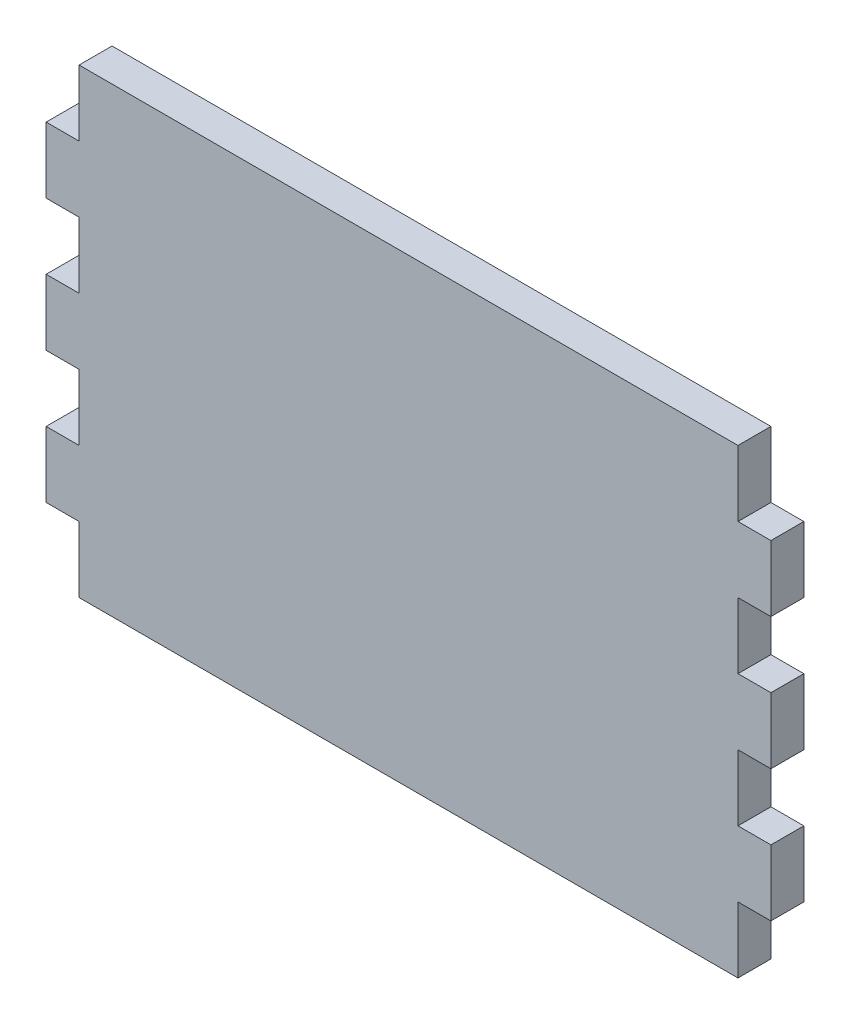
ISO-10303-21;
HEADER;
FILE_DESCRIPTION(('STEP AP214'),'2;1');
FILE_NAME('part.step','',(''),(''),'','','');
FILE_SCHEMA(('AUTOMOTIVE_DESIGN { 1 0 10303 214 1 1 1 1 }'));
ENDSEC;
DATA;
#1=APPLICATION_CONTEXT('core data for automotive mechanical design processes');
#2=APPLICATION_PROTOCOL_DEFINITION('international standard','automotive_design',2000,#1);
#3=PRODUCT_CONTEXT('',#1,'mechanical');
#4=PRODUCT('Part','Part','',(#3));
#5=PRODUCT_RELATED_PRODUCT_CATEGORY('part','',(#4));
#6=PRODUCT_DEFINITION_FORMATION('','',#4);
#7=PRODUCT_DEFINITION_CONTEXT('part definition',#1,'design');
#8=PRODUCT_DEFINITION('design','',#6,#7);
#9=PRODUCT_DEFINITION_SHAPE('','',#8);
#10=(LENGTH_UNIT() NAMED_UNIT(*) SI_UNIT(.MILLI.,.METRE.));
#11=(NAMED_UNIT(*) PLANE_ANGLE_UNIT() SI_UNIT($,.RADIAN.));
#12=(NAMED_UNIT(*) SI_UNIT($,.STERADIAN.) SOLID_ANGLE_UNIT());
#13=UNCERTAINTY_MEASURE_WITH_UNIT(LENGTH_MEASURE(1.E-05),#10,'distance_accuracy_value','');
#14=(GEOMETRIC_REPRESENTATION_CONTEXT(3) GLOBAL_UNCERTAINTY_ASSIGNED_CONTEXT((#13)) GLOBAL_UNIT_ASSIGNED_CONTEXT((#10,
#11,#12)) REPRESENTATION_CONTEXT('',''));
#15=CARTESIAN_POINT('',(0.,0.,0.));
#16=DIRECTION('',(0.,0.,1.));
#17=DIRECTION('',(1.,0.,0.));
#18=AXIS2_PLACEMENT_3D('',#15,#16,#17);
#19=CARTESIAN_POINT('',(50.,-35.,5.));
#20=DIRECTION('',(-1.,0.,0.));
#21=DIRECTION('',(0.,0.,1.));
#22=AXIS2_PLACEMENT_3D('',#19,#20,#21);
#23=PLANE('',#22);
#24=DIRECTION('',(0.,1.,0.));
#25=VECTOR('',#24,1.);
#26=CARTESIAN_POINT('',(50.,-35.,5.));
#27=LINE('',#26,#25);
#28=CARTESIAN_POINT('',(50.,25.,5.));
#29=VERTEX_POINT('',#28);
#30=CARTESIAN_POINT('',(50.,35.,5.));
#31=VERTEX_POINT('',#30);
#32=EDGE_CURVE('E389',#29,#31,#27,.T.);
#33=ORIENTED_EDGE('',*,*,#32,.F.);
#34=DIRECTION('',(0.,0.,-1.));
#35=VECTOR('',#34,1.);
#36=CARTESIAN_POINT('',(50.,25.,5.));
#37=LINE('',#36,#35);
#38=CARTESIAN_POINT('',(50.,25.,0.));
#39=VERTEX_POINT('',#38);
#40=EDGE_CURVE('E278',#29,#39,#37,.T.);
#41=ORIENTED_EDGE('',*,*,#40,.T.);
#42=DIRECTION('',(0.,1.,0.));
#43=VECTOR('',#42,1.);
#44=CARTESIAN_POINT('',(50.,-35.,0.));
#45=LINE('',#44,#43);
#46=CARTESIAN_POINT('',(50.,35.,0.));
#47=VERTEX_POINT('',#46);
#48=EDGE_CURVE('E383',#39,#47,#45,.T.);
#49=ORIENTED_EDGE('',*,*,#48,.T.);
#50=DIRECTION('',(0.,0.,-1.));
#51=VECTOR('',#50,1.);
#52=CARTESIAN_POINT('',(50.,35.,5.));
#53=LINE('',#52,#51);
#54=EDGE_CURVE('E11',#31,#47,#53,.T.);
#55=ORIENTED_EDGE('',*,*,#54,.F.);
#56=EDGE_LOOP('',(#33,#41,#49,#55));
#57=FACE_BOUND('',#56,.T.);
#58=ADVANCED_FACE('F39',(#57),#23,.F.);
#59=CARTESIAN_POINT('',(-50.,-35.,5.));
#60=DIRECTION('',(1.,0.,0.));
#61=DIRECTION('',(0.,0.,-1.));
#62=AXIS2_PLACEMENT_3D('',#59,#60,#61);
#63=PLANE('',#62);
#64=DIRECTION('',(0.,-1.,0.));
#65=VECTOR('',#64,1.);
#66=CARTESIAN_POINT('',(-50.,-35.,0.));
#67=LINE('',#66,#65);
#68=CARTESIAN_POINT('',(-50.,35.,0.));
#69=VERTEX_POINT('',#68);
#70=CARTESIAN_POINT('',(-50.,25.,0.));
#71=VERTEX_POINT('',#70);
#72=EDGE_CURVE('E406',#69,#71,#67,.T.);
#73=ORIENTED_EDGE('',*,*,#72,.T.);
#74=DIRECTION('',(0.,0.,1.));
#75=VECTOR('',#74,1.);
#76=CARTESIAN_POINT('',(-50.,25.,5.));
#77=LINE('',#76,#75);
#78=CARTESIAN_POINT('',(-50.,25.,5.));
#79=VERTEX_POINT('',#78);
#80=EDGE_CURVE('E275',#71,#79,#77,.T.);
#81=ORIENTED_EDGE('',*,*,#80,.T.);
#82=DIRECTION('',(0.,-1.,0.));
#83=VECTOR('',#82,1.);
#84=CARTESIAN_POINT('',(-50.,-35.,5.));
#85=LINE('',#84,#83);
#86=CARTESIAN_POINT('',(-50.,35.,5.));
#87=VERTEX_POINT('',#86);
#88=EDGE_CURVE('E392',#87,#79,#85,.T.);
#89=ORIENTED_EDGE('',*,*,#88,.F.);
#90=DIRECTION('',(0.,0.,-1.));
#91=VECTOR('',#90,1.);
#92=CARTESIAN_POINT('',(-50.,35.,5.));
#93=LINE('',#92,#91);
#94=EDGE_CURVE('E47',#87,#69,#93,.T.);
#95=ORIENTED_EDGE('',*,*,#94,.T.);
#96=EDGE_LOOP('',(#73,#81,#89,#95));
#97=FACE_BOUND('',#96,.T.);
#98=ADVANCED_FACE('F421',(#97),#63,.F.);
#99=CARTESIAN_POINT('',(50.,5.,0.));
#100=VERTEX_POINT('',#99);
#101=CARTESIAN_POINT('',(50.,15.,0.));
#102=VERTEX_POINT('',#101);
#103=EDGE_CURVE('E438',#100,#102,#45,.T.);
#104=ORIENTED_EDGE('',*,*,#103,.T.);
#105=DIRECTION('',(0.,0.,1.));
#106=VECTOR('',#105,1.);
#107=CARTESIAN_POINT('',(50.,15.,5.));
#108=LINE('',#107,#106);
#109=CARTESIAN_POINT('',(50.,15.,5.));
#110=VERTEX_POINT('',#109);
#111=EDGE_CURVE('E273',#102,#110,#108,.T.);
#112=ORIENTED_EDGE('',*,*,#111,.T.);
#113=CARTESIAN_POINT('',(50.,5.,5.));
#114=VERTEX_POINT('',#113);
#115=EDGE_CURVE('E230',#114,#110,#27,.T.);
#116=ORIENTED_EDGE('',*,*,#115,.F.);
#117=DIRECTION('',(0.,0.,-1.));
#118=VECTOR('',#117,1.);
#119=CARTESIAN_POINT('',(50.,5.,5.00000000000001));
#120=LINE('',#119,#118);
#121=EDGE_CURVE('E329',#114,#100,#120,.T.);
#122=ORIENTED_EDGE('',*,*,#121,.T.);
#123=EDGE_LOOP('',(#104,#112,#116,#122));
#124=FACE_BOUND('',#123,.T.);
#125=ADVANCED_FACE('F509',(#124),#23,.F.);
#126=CARTESIAN_POINT('',(-50.,15.,5.));
#127=VERTEX_POINT('',#126);
#128=CARTESIAN_POINT('',(-50.,5.,5.));
#129=VERTEX_POINT('',#128);
#130=EDGE_CURVE('E396',#127,#129,#85,.T.);
#131=ORIENTED_EDGE('',*,*,#130,.F.);
#132=DIRECTION('',(0.,0.,-1.));
#133=VECTOR('',#132,1.);
#134=CARTESIAN_POINT('',(-50.,15.,5.));
#135=LINE('',#134,#133);
#136=CARTESIAN_POINT('',(-50.,15.,0.));
#137=VERTEX_POINT('',#136);
#138=EDGE_CURVE('E264',#127,#137,#135,.T.);
#139=ORIENTED_EDGE('',*,*,#138,.T.);
#140=CARTESIAN_POINT('',(-50.,5.,0.));
#141=VERTEX_POINT('',#140);
#142=EDGE_CURVE('E410',#137,#141,#67,.T.);
#143=ORIENTED_EDGE('',*,*,#142,.T.);
#144=DIRECTION('',(0.,0.,1.));
#145=VECTOR('',#144,1.);
#146=CARTESIAN_POINT('',(-50.,5.,5.00000000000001));
#147=LINE('',#146,#145);
#148=EDGE_CURVE('E326',#141,#129,#147,.T.);
#149=ORIENTED_EDGE('',*,*,#148,.T.);
#150=EDGE_LOOP('',(#131,#139,#143,#149));
#151=FACE_BOUND('',#150,.T.);
#152=ADVANCED_FACE('F487',(#151),#63,.F.);
#153=CARTESIAN_POINT('',(50.,-15.,0.));
#154=VERTEX_POINT('',#153);
#155=CARTESIAN_POINT('',(50.,-5.,0.));
#156=VERTEX_POINT('',#155);
#157=EDGE_CURVE('E403',#154,#156,#45,.T.);
#158=ORIENTED_EDGE('',*,*,#157,.T.);
#159=DIRECTION('',(0.,0.,1.));
#160=VECTOR('',#159,1.);
#161=CARTESIAN_POINT('',(50.,-5.,5.));
#162=LINE('',#161,#160);
#163=CARTESIAN_POINT('',(50.,-5.,5.));
#164=VERTEX_POINT('',#163);
#165=EDGE_CURVE('E323',#156,#164,#162,.T.);
#166=ORIENTED_EDGE('',*,*,#165,.T.);
#167=CARTESIAN_POINT('',(50.,-15.,5.));
#168=VERTEX_POINT('',#167);
#169=EDGE_CURVE('E388',#168,#164,#27,.T.);
#170=ORIENTED_EDGE('',*,*,#169,.F.);
#171=DIRECTION('',(0.,0.,-1.));
#172=VECTOR('',#171,1.);
#173=CARTESIAN_POINT('',(50.,-15.,5.00000000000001));
#174=LINE('',#173,#172);
#175=EDGE_CURVE('E380',#168,#154,#174,.T.);
#176=ORIENTED_EDGE('',*,*,#175,.T.);
#177=EDGE_LOOP('',(#158,#166,#170,#176));
#178=FACE_BOUND('',#177,.T.);
#179=ADVANCED_FACE('F445',(#178),#23,.F.);
#180=CARTESIAN_POINT('',(-50.,-5.,5.));
#181=VERTEX_POINT('',#180);
#182=CARTESIAN_POINT('',(-50.,-15.,5.));
#183=VERTEX_POINT('',#182);
#184=EDGE_CURVE('E497',#181,#183,#85,.T.);
#185=ORIENTED_EDGE('',*,*,#184,.F.);
#186=DIRECTION('',(0.,0.,-1.));
#187=VECTOR('',#186,1.);
#188=CARTESIAN_POINT('',(-50.,-5.,5.));
#189=LINE('',#188,#187);
#190=CARTESIAN_POINT('',(-50.,-5.,0.));
#191=VERTEX_POINT('',#190);
#192=EDGE_CURVE('E309',#181,#191,#189,.T.);
#193=ORIENTED_EDGE('',*,*,#192,.T.);
#194=CARTESIAN_POINT('',(-50.,-15.,0.));
#195=VERTEX_POINT('',#194);
#196=EDGE_CURVE('E480',#191,#195,#67,.T.);
#197=ORIENTED_EDGE('',*,*,#196,.T.);
#198=DIRECTION('',(0.,0.,1.));
#199=VECTOR('',#198,1.);
#200=CARTESIAN_POINT('',(-50.,-15.,5.00000000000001));
#201=LINE('',#200,#199);
#202=EDGE_CURVE('E377',#195,#183,#201,.T.);
#203=ORIENTED_EDGE('',*,*,#202,.T.);
#204=EDGE_LOOP('',(#185,#193,#197,#203));
#205=FACE_BOUND('',#204,.T.);
#206=ADVANCED_FACE('F502',(#205),#63,.F.);
#207=CARTESIAN_POINT('',(50.,-35.,0.));
#208=VERTEX_POINT('',#207);
#209=CARTESIAN_POINT('',(50.,-25.,0.));
#210=VERTEX_POINT('',#209);
#211=EDGE_CURVE('E399',#208,#210,#45,.T.);
#212=ORIENTED_EDGE('',*,*,#211,.T.);
#213=DIRECTION('',(0.,0.,1.));
#214=VECTOR('',#213,1.);
#215=CARTESIAN_POINT('',(50.,-25.,5.));
#216=LINE('',#215,#214);
#217=CARTESIAN_POINT('',(50.,-25.,5.));
#218=VERTEX_POINT('',#217);
#219=EDGE_CURVE('E374',#210,#218,#216,.T.);
#220=ORIENTED_EDGE('',*,*,#219,.T.);
#221=CARTESIAN_POINT('',(50.,-35.,5.));
#222=VERTEX_POINT('',#221);
#223=EDGE_CURVE('E384',#222,#218,#27,.T.);
#224=ORIENTED_EDGE('',*,*,#223,.F.);
#225=DIRECTION('',(0.,0.,-1.));
#226=VECTOR('',#225,1.);
#227=CARTESIAN_POINT('',(50.,-35.,5.));
#228=LINE('',#227,#226);
#229=EDGE_CURVE('E398',#222,#208,#228,.T.);
#230=ORIENTED_EDGE('',*,*,#229,.T.);
#231=EDGE_LOOP('',(#212,#220,#224,#230));
#232=FACE_BOUND('',#231,.T.);
#233=ADVANCED_FACE('F41',(#232),#23,.F.);
#234=CARTESIAN_POINT('',(-50.,35.,5.));
#235=DIRECTION('',(0.,-1.,0.));
#236=DIRECTION('',(0.,0.,-1.));
#237=AXIS2_PLACEMENT_3D('',#234,#235,#236);
#238=PLANE('',#237);
#239=DIRECTION('',(-1.,0.,0.));
#240=VECTOR('',#239,1.);
#241=CARTESIAN_POINT('',(-50.,35.,0.));
#242=LINE('',#241,#240);
#243=EDGE_CURVE('E402',#47,#69,#242,.T.);
#244=ORIENTED_EDGE('',*,*,#243,.T.);
#245=ORIENTED_EDGE('',*,*,#94,.F.);
#246=DIRECTION('',(-1.,0.,0.));
#247=VECTOR('',#246,1.);
#248=CARTESIAN_POINT('',(-50.,35.,5.));
#249=LINE('',#248,#247);
#250=EDGE_CURVE('E387',#31,#87,#249,.T.);
#251=ORIENTED_EDGE('',*,*,#250,.F.);
#252=ORIENTED_EDGE('',*,*,#54,.T.);
#253=EDGE_LOOP('',(#244,#245,#251,#252));
#254=FACE_BOUND('',#253,.T.);
#255=ADVANCED_FACE('F436',(#254),#238,.F.);
#256=CARTESIAN_POINT('',(-50.,-25.,5.));
#257=VERTEX_POINT('',#256);
#258=CARTESIAN_POINT('',(-50.,-35.,5.));
#259=VERTEX_POINT('',#258);
#260=EDGE_CURVE('E391',#257,#259,#85,.T.);
#261=ORIENTED_EDGE('',*,*,#260,.F.);
#262=DIRECTION('',(0.,0.,-1.));
#263=VECTOR('',#262,1.);
#264=CARTESIAN_POINT('',(-50.,-25.,5.));
#265=LINE('',#264,#263);
#266=CARTESIAN_POINT('',(-50.,-25.,0.));
#267=VERTEX_POINT('',#266);
#268=EDGE_CURVE('E360',#257,#267,#265,.T.);
#269=ORIENTED_EDGE('',*,*,#268,.T.);
#270=CARTESIAN_POINT('',(-50.,-35.,0.));
#271=VERTEX_POINT('',#270);
#272=EDGE_CURVE('E405',#267,#271,#67,.T.);
#273=ORIENTED_EDGE('',*,*,#272,.T.);
#274=DIRECTION('',(0.,0.,-1.));
#275=VECTOR('',#274,1.);
#276=CARTESIAN_POINT('',(-50.,-35.,5.));
#277=LINE('',#276,#275);
#278=EDGE_CURVE('E414',#259,#271,#277,.T.);
#279=ORIENTED_EDGE('',*,*,#278,.F.);
#280=EDGE_LOOP('',(#261,#269,#273,#279));
#281=FACE_BOUND('',#280,.T.);
#282=ADVANCED_FACE('F499',(#281),#63,.F.);
#283=CARTESIAN_POINT('',(-50.,-35.,5.));
#284=DIRECTION('',(0.,1.,0.));
#285=DIRECTION('',(0.,0.,1.));
#286=AXIS2_PLACEMENT_3D('',#283,#284,#285);
#287=PLANE('',#286);
#288=DIRECTION('',(1.,0.,0.));
#289=VECTOR('',#288,1.);
#290=CARTESIAN_POINT('',(-50.,-35.,0.));
#291=LINE('',#290,#289);
#292=EDGE_CURVE('E409',#271,#208,#291,.T.);
#293=ORIENTED_EDGE('',*,*,#292,.T.);
#294=ORIENTED_EDGE('',*,*,#229,.F.);
#295=DIRECTION('',(1.,0.,0.));
#296=VECTOR('',#295,1.);
#297=CARTESIAN_POINT('',(-50.,-35.,5.));
#298=LINE('',#297,#296);
#299=EDGE_CURVE('E395',#259,#222,#298,.T.);
#300=ORIENTED_EDGE('',*,*,#299,.F.);
#301=ORIENTED_EDGE('',*,*,#278,.T.);
#302=EDGE_LOOP('',(#293,#294,#300,#301));
#303=FACE_BOUND('',#302,.T.);
#304=ADVANCED_FACE('F475',(#303),#287,.F.);
#305=CARTESIAN_POINT('',(0.,0.,5.));
#306=DIRECTION('',(0.,0.,-1.));
#307=DIRECTION('',(-1.,0.,0.));
#308=AXIS2_PLACEMENT_3D('',#305,#306,#307);
#309=PLANE('',#308);
#310=ORIENTED_EDGE('',*,*,#115,.T.);
#311=DIRECTION('',(1.,0.,0.));
#312=VECTOR('',#311,1.);
#313=CARTESIAN_POINT('',(-55.,15.,5.));
#314=LINE('',#313,#312);
#315=CARTESIAN_POINT('',(55.,15.,5.));
#316=VERTEX_POINT('',#315);
#317=EDGE_CURVE('E54',#110,#316,#314,.T.);
#318=ORIENTED_EDGE('',*,*,#317,.T.);
#319=DIRECTION('',(0.,-1.,0.));
#320=VECTOR('',#319,1.);
#321=CARTESIAN_POINT('',(55.,15.,5.));
#322=LINE('',#321,#320);
#323=CARTESIAN_POINT('',(55.,25.,5.));
#324=VERTEX_POINT('',#323);
#325=EDGE_CURVE('E227',#324,#316,#322,.T.);
#326=ORIENTED_EDGE('',*,*,#325,.F.);
#327=DIRECTION('',(1.,0.,0.));
#328=VECTOR('',#327,1.);
#329=CARTESIAN_POINT('',(-55.,25.,5.));
#330=LINE('',#329,#328);
#331=EDGE_CURVE('E265',#29,#324,#330,.T.);
#332=ORIENTED_EDGE('',*,*,#331,.F.);
#333=ORIENTED_EDGE('',*,*,#32,.T.);
#334=ORIENTED_EDGE('',*,*,#250,.T.);
#335=ORIENTED_EDGE('',*,*,#88,.T.);
#336=CARTESIAN_POINT('',(-55.,25.,5.));
#337=VERTEX_POINT('',#336);
#338=EDGE_CURVE('E262',#337,#79,#330,.T.);
#339=ORIENTED_EDGE('',*,*,#338,.F.);
#340=DIRECTION('',(0.,-1.,0.));
#341=VECTOR('',#340,1.);
#342=CARTESIAN_POINT('',(-55.,15.,5.));
#343=LINE('',#342,#341);
#344=CARTESIAN_POINT('',(-55.,15.,5.));
#345=VERTEX_POINT('',#344);
#346=EDGE_CURVE('E252',#337,#345,#343,.T.);
#347=ORIENTED_EDGE('',*,*,#346,.T.);
#348=EDGE_CURVE('E231',#345,#127,#314,.T.);
#349=ORIENTED_EDGE('',*,*,#348,.T.);
#350=ORIENTED_EDGE('',*,*,#130,.T.);
#351=DIRECTION('',(1.,0.,0.));
#352=VECTOR('',#351,1.);
#353=CARTESIAN_POINT('',(-55.,5.,5.));
#354=LINE('',#353,#352);
#355=CARTESIAN_POINT('',(-55.,5.,5.));
#356=VERTEX_POINT('',#355);
#357=EDGE_CURVE('E306',#356,#129,#354,.T.);
#358=ORIENTED_EDGE('',*,*,#357,.F.);
#359=DIRECTION('',(0.,-1.,0.));
#360=VECTOR('',#359,1.);
#361=CARTESIAN_POINT('',(-55.,-5.,5.));
#362=LINE('',#361,#360);
#363=CARTESIAN_POINT('',(-55.,-5.,5.));
#364=VERTEX_POINT('',#363);
#365=EDGE_CURVE('E293',#356,#364,#362,.T.);
#366=ORIENTED_EDGE('',*,*,#365,.T.);
#367=DIRECTION('',(1.,0.,0.));
#368=VECTOR('',#367,1.);
#369=CARTESIAN_POINT('',(-55.,-5.,5.));
#370=LINE('',#369,#368);
#371=EDGE_CURVE('E318',#364,#181,#370,.T.);
#372=ORIENTED_EDGE('',*,*,#371,.T.);
#373=ORIENTED_EDGE('',*,*,#184,.T.);
#374=DIRECTION('',(1.,0.,0.));
#375=VECTOR('',#374,1.);
#376=CARTESIAN_POINT('',(-55.,-15.,5.));
#377=LINE('',#376,#375);
#378=CARTESIAN_POINT('',(-55.,-15.,5.));
#379=VERTEX_POINT('',#378);
#380=EDGE_CURVE('E357',#379,#183,#377,.T.);
#381=ORIENTED_EDGE('',*,*,#380,.F.);
#382=DIRECTION('',(0.,-1.,0.));
#383=VECTOR('',#382,1.);
#384=CARTESIAN_POINT('',(-55.,-25.,5.));
#385=LINE('',#384,#383);
#386=CARTESIAN_POINT('',(-55.,-25.,5.));
#387=VERTEX_POINT('',#386);
#388=EDGE_CURVE('E344',#379,#387,#385,.T.);
#389=ORIENTED_EDGE('',*,*,#388,.T.);
#390=DIRECTION('',(1.,0.,0.));
#391=VECTOR('',#390,1.);
#392=CARTESIAN_POINT('',(-55.,-25.,5.));
#393=LINE('',#392,#391);
#394=EDGE_CURVE('E369',#387,#257,#393,.T.);
#395=ORIENTED_EDGE('',*,*,#394,.T.);
#396=ORIENTED_EDGE('',*,*,#260,.T.);
#397=ORIENTED_EDGE('',*,*,#299,.T.);
#398=ORIENTED_EDGE('',*,*,#223,.T.);
#399=CARTESIAN_POINT('',(55.,-25.,5.));
#400=VERTEX_POINT('',#399);
#401=EDGE_CURVE('E356',#218,#400,#393,.T.);
#402=ORIENTED_EDGE('',*,*,#401,.T.);
#403=DIRECTION('',(0.,-1.,0.));
#404=VECTOR('',#403,1.);
#405=CARTESIAN_POINT('',(55.,-25.,5.));
#406=LINE('',#405,#404);
#407=CARTESIAN_POINT('',(55.,-15.,5.));
#408=VERTEX_POINT('',#407);
#409=EDGE_CURVE('E332',#408,#400,#406,.T.);
#410=ORIENTED_EDGE('',*,*,#409,.F.);
#411=EDGE_CURVE('E361',#168,#408,#377,.T.);
#412=ORIENTED_EDGE('',*,*,#411,.F.);
#413=ORIENTED_EDGE('',*,*,#169,.T.);
#414=CARTESIAN_POINT('',(55.,-5.,5.));
#415=VERTEX_POINT('',#414);
#416=EDGE_CURVE('E305',#164,#415,#370,.T.);
#417=ORIENTED_EDGE('',*,*,#416,.T.);
#418=DIRECTION('',(0.,-1.,0.));
#419=VECTOR('',#418,1.);
#420=CARTESIAN_POINT('',(55.,-5.,5.));
#421=LINE('',#420,#419);
#422=CARTESIAN_POINT('',(55.,5.,5.));
#423=VERTEX_POINT('',#422);
#424=EDGE_CURVE('E281',#423,#415,#421,.T.);
#425=ORIENTED_EDGE('',*,*,#424,.F.);
#426=EDGE_CURVE('E310',#114,#423,#354,.T.);
#427=ORIENTED_EDGE('',*,*,#426,.F.);
#428=EDGE_LOOP('',(#310,#318,#326,#332,#333,#334,#335,#339,#347,#349,#350,#358,#366,#372,#373,
#381,#389,#395,#396,#397,#398,#402,#410,#412,#413,#417,#425,#427));
#429=FACE_BOUND('',#428,.T.);
#430=ADVANCED_FACE('F224',(#429),#309,.F.);
#431=CARTESIAN_POINT('',(0.,0.,0.));
#432=DIRECTION('',(0.,0.,-1.));
#433=DIRECTION('',(-1.,0.,0.));
#434=AXIS2_PLACEMENT_3D('',#431,#432,#433);
#435=PLANE('',#434);
#436=ORIENTED_EDGE('',*,*,#142,.F.);
#437=DIRECTION('',(1.,0.,0.));
#438=VECTOR('',#437,1.);
#439=CARTESIAN_POINT('',(-55.,15.,0.));
#440=LINE('',#439,#438);
#441=CARTESIAN_POINT('',(-55.,15.,0.));
#442=VERTEX_POINT('',#441);
#443=EDGE_CURVE('E62',#442,#137,#440,.T.);
#444=ORIENTED_EDGE('',*,*,#443,.F.);
#445=DIRECTION('',(0.,1.,0.));
#446=VECTOR('',#445,1.);
#447=CARTESIAN_POINT('',(-55.,15.,0.));
#448=LINE('',#447,#446);
#449=CARTESIAN_POINT('',(-55.,25.,0.));
#450=VERTEX_POINT('',#449);
#451=EDGE_CURVE('E257',#442,#450,#448,.T.);
#452=ORIENTED_EDGE('',*,*,#451,.T.);
#453=DIRECTION('',(1.,0.,0.));
#454=VECTOR('',#453,1.);
#455=CARTESIAN_POINT('',(-55.,25.,0.));
#456=LINE('',#455,#454);
#457=EDGE_CURVE('E266',#450,#71,#456,.T.);
#458=ORIENTED_EDGE('',*,*,#457,.T.);
#459=ORIENTED_EDGE('',*,*,#72,.F.);
#460=ORIENTED_EDGE('',*,*,#243,.F.);
#461=ORIENTED_EDGE('',*,*,#48,.F.);
#462=CARTESIAN_POINT('',(55.,25.,0.));
#463=VERTEX_POINT('',#462);
#464=EDGE_CURVE('E269',#39,#463,#456,.T.);
#465=ORIENTED_EDGE('',*,*,#464,.T.);
#466=DIRECTION('',(0.,1.,0.));
#467=VECTOR('',#466,1.);
#468=CARTESIAN_POINT('',(55.,15.,0.));
#469=LINE('',#468,#467);
#470=CARTESIAN_POINT('',(55.,15.,0.));
#471=VERTEX_POINT('',#470);
#472=EDGE_CURVE('E242',#471,#463,#469,.T.);
#473=ORIENTED_EDGE('',*,*,#472,.F.);
#474=EDGE_CURVE('E238',#102,#471,#440,.T.);
#475=ORIENTED_EDGE('',*,*,#474,.F.);
#476=ORIENTED_EDGE('',*,*,#103,.F.);
#477=DIRECTION('',(1.,0.,0.));
#478=VECTOR('',#477,1.);
#479=CARTESIAN_POINT('',(-55.,5.,0.));
#480=LINE('',#479,#478);
#481=CARTESIAN_POINT('',(55.,5.,0.));
#482=VERTEX_POINT('',#481);
#483=EDGE_CURVE('E314',#100,#482,#480,.T.);
#484=ORIENTED_EDGE('',*,*,#483,.T.);
#485=DIRECTION('',(0.,1.,0.));
#486=VECTOR('',#485,1.);
#487=CARTESIAN_POINT('',(55.,-5.,0.));
#488=LINE('',#487,#486);
#489=CARTESIAN_POINT('',(55.,-5.,0.));
#490=VERTEX_POINT('',#489);
#491=EDGE_CURVE('E287',#490,#482,#488,.T.);
#492=ORIENTED_EDGE('',*,*,#491,.F.);
#493=DIRECTION('',(1.,0.,0.));
#494=VECTOR('',#493,1.);
#495=CARTESIAN_POINT('',(-55.,-5.,0.));
#496=LINE('',#495,#494);
#497=EDGE_CURVE('E317',#156,#490,#496,.T.);
#498=ORIENTED_EDGE('',*,*,#497,.F.);
#499=ORIENTED_EDGE('',*,*,#157,.F.);
#500=DIRECTION('',(1.,0.,0.));
#501=VECTOR('',#500,1.);
#502=CARTESIAN_POINT('',(-55.,-15.,0.));
#503=LINE('',#502,#501);
#504=CARTESIAN_POINT('',(55.,-15.,0.));
#505=VERTEX_POINT('',#504);
#506=EDGE_CURVE('E365',#154,#505,#503,.T.);
#507=ORIENTED_EDGE('',*,*,#506,.T.);
#508=DIRECTION('',(0.,1.,0.));
#509=VECTOR('',#508,1.);
#510=CARTESIAN_POINT('',(55.,-25.,0.));
#511=LINE('',#510,#509);
#512=CARTESIAN_POINT('',(55.,-25.,0.));
#513=VERTEX_POINT('',#512);
#514=EDGE_CURVE('E338',#513,#505,#511,.T.);
#515=ORIENTED_EDGE('',*,*,#514,.F.);
#516=DIRECTION('',(1.,0.,0.));
#517=VECTOR('',#516,1.);
#518=CARTESIAN_POINT('',(-55.,-25.,0.));
#519=LINE('',#518,#517);
#520=EDGE_CURVE('E368',#210,#513,#519,.T.);
#521=ORIENTED_EDGE('',*,*,#520,.F.);
#522=ORIENTED_EDGE('',*,*,#211,.F.);
#523=ORIENTED_EDGE('',*,*,#292,.F.);
#524=ORIENTED_EDGE('',*,*,#272,.F.);
#525=CARTESIAN_POINT('',(-55.,-25.,0.));
#526=VERTEX_POINT('',#525);
#527=EDGE_CURVE('E366',#526,#267,#519,.T.);
#528=ORIENTED_EDGE('',*,*,#527,.F.);
#529=DIRECTION('',(0.,1.,0.));
#530=VECTOR('',#529,1.);
#531=CARTESIAN_POINT('',(-55.,-25.,0.));
#532=LINE('',#531,#530);
#533=CARTESIAN_POINT('',(-55.,-15.,0.));
#534=VERTEX_POINT('',#533);
#535=EDGE_CURVE('E350',#526,#534,#532,.T.);
#536=ORIENTED_EDGE('',*,*,#535,.T.);
#537=EDGE_CURVE('E362',#534,#195,#503,.T.);
#538=ORIENTED_EDGE('',*,*,#537,.T.);
#539=ORIENTED_EDGE('',*,*,#196,.F.);
#540=CARTESIAN_POINT('',(-55.,-5.,0.));
#541=VERTEX_POINT('',#540);
#542=EDGE_CURVE('E315',#541,#191,#496,.T.);
#543=ORIENTED_EDGE('',*,*,#542,.F.);
#544=DIRECTION('',(0.,1.,0.));
#545=VECTOR('',#544,1.);
#546=CARTESIAN_POINT('',(-55.,-5.,0.));
#547=LINE('',#546,#545);
#548=CARTESIAN_POINT('',(-55.,5.,0.));
#549=VERTEX_POINT('',#548);
#550=EDGE_CURVE('E299',#541,#549,#547,.T.);
#551=ORIENTED_EDGE('',*,*,#550,.T.);
#552=EDGE_CURVE('E311',#549,#141,#480,.T.);
#553=ORIENTED_EDGE('',*,*,#552,.T.);
#554=EDGE_LOOP('',(#436,#444,#452,#458,#459,#460,#461,#465,#473,#475,#476,#484,#492,#498,#499,
#507,#515,#521,#522,#523,#524,#528,#536,#538,#539,#543,#551,#553));
#555=FACE_BOUND('',#554,.T.);
#556=ADVANCED_FACE('F427',(#555),#435,.T.);
#557=CARTESIAN_POINT('',(-55.,0.,0.));
#558=DIRECTION('',(-1.,0.,0.));
#559=DIRECTION('',(0.,0.,1.));
#560=AXIS2_PLACEMENT_3D('',#557,#558,#559);
#561=PLANE('',#560);
#562=ORIENTED_EDGE('',*,*,#388,.F.);
#563=DIRECTION('',(0.,0.,1.));
#564=VECTOR('',#563,1.);
#565=CARTESIAN_POINT('',(-55.,-15.,5.));
#566=LINE('',#565,#564);
#567=EDGE_CURVE('E353',#534,#379,#566,.T.);
#568=ORIENTED_EDGE('',*,*,#567,.F.);
#569=ORIENTED_EDGE('',*,*,#535,.F.);
#570=DIRECTION('',(0.,0.,-1.));
#571=VECTOR('',#570,1.);
#572=CARTESIAN_POINT('',(-55.,-25.,5.));
#573=LINE('',#572,#571);
#574=EDGE_CURVE('E347',#387,#526,#573,.T.);
#575=ORIENTED_EDGE('',*,*,#574,.F.);
#576=EDGE_LOOP('',(#562,#568,#569,#575));
#577=FACE_BOUND('',#576,.T.);
#578=ADVANCED_FACE('F578',(#577),#561,.T.);
#579=CARTESIAN_POINT('',(-55.,-25.,5.));
#580=DIRECTION('',(0.,-1.,0.));
#581=DIRECTION('',(0.,0.,-1.));
#582=AXIS2_PLACEMENT_3D('',#579,#580,#581);
#583=PLANE('',#582);
#584=ORIENTED_EDGE('',*,*,#268,.F.);
#585=ORIENTED_EDGE('',*,*,#394,.F.);
#586=ORIENTED_EDGE('',*,*,#574,.T.);
#587=ORIENTED_EDGE('',*,*,#527,.T.);
#588=EDGE_LOOP('',(#584,#585,#586,#587));
#589=FACE_BOUND('',#588,.T.);
#590=ADVANCED_FACE('F588',(#589),#583,.T.);
#591=CARTESIAN_POINT('',(-55.,-15.,5.));
#592=DIRECTION('',(0.,1.,0.));
#593=DIRECTION('',(0.,0.,1.));
#594=AXIS2_PLACEMENT_3D('',#591,#592,#593);
#595=PLANE('',#594);
#596=ORIENTED_EDGE('',*,*,#202,.F.);
#597=ORIENTED_EDGE('',*,*,#537,.F.);
#598=ORIENTED_EDGE('',*,*,#567,.T.);
#599=ORIENTED_EDGE('',*,*,#380,.T.);
#600=EDGE_LOOP('',(#596,#597,#598,#599));
#601=FACE_BOUND('',#600,.T.);
#602=ADVANCED_FACE('F598',(#601),#595,.T.);
#603=ORIENTED_EDGE('',*,*,#175,.F.);
#604=ORIENTED_EDGE('',*,*,#411,.T.);
#605=DIRECTION('',(0.,0.,1.));
#606=VECTOR('',#605,1.);
#607=CARTESIAN_POINT('',(55.,-15.,5.));
#608=LINE('',#607,#606);
#609=EDGE_CURVE('E341',#505,#408,#608,.T.);
#610=ORIENTED_EDGE('',*,*,#609,.F.);
#611=ORIENTED_EDGE('',*,*,#506,.F.);
#612=EDGE_LOOP('',(#603,#604,#610,#611));
#613=FACE_BOUND('',#612,.T.);
#614=ADVANCED_FACE('F462',(#613),#595,.T.);
#615=ORIENTED_EDGE('',*,*,#219,.F.);
#616=ORIENTED_EDGE('',*,*,#520,.T.);
#617=DIRECTION('',(0.,0.,-1.));
#618=VECTOR('',#617,1.);
#619=CARTESIAN_POINT('',(55.,-25.,5.));
#620=LINE('',#619,#618);
#621=EDGE_CURVE('E335',#400,#513,#620,.T.);
#622=ORIENTED_EDGE('',*,*,#621,.F.);
#623=ORIENTED_EDGE('',*,*,#401,.F.);
#624=EDGE_LOOP('',(#615,#616,#622,#623));
#625=FACE_BOUND('',#624,.T.);
#626=ADVANCED_FACE('F601',(#625),#583,.T.);
#627=CARTESIAN_POINT('',(55.,0.,0.));
#628=DIRECTION('',(-1.,0.,0.));
#629=DIRECTION('',(0.,0.,1.));
#630=AXIS2_PLACEMENT_3D('',#627,#628,#629);
#631=PLANE('',#630);
#632=ORIENTED_EDGE('',*,*,#409,.T.);
#633=ORIENTED_EDGE('',*,*,#621,.T.);
#634=ORIENTED_EDGE('',*,*,#514,.T.);
#635=ORIENTED_EDGE('',*,*,#609,.T.);
#636=EDGE_LOOP('',(#632,#633,#634,#635));
#637=FACE_BOUND('',#636,.T.);
#638=ADVANCED_FACE('F464',(#637),#631,.F.);
#639=CARTESIAN_POINT('',(-55.,0.,0.));
#640=DIRECTION('',(-1.,0.,0.));
#641=DIRECTION('',(0.,0.,1.));
#642=AXIS2_PLACEMENT_3D('',#639,#640,#641);
#643=PLANE('',#642);
#644=ORIENTED_EDGE('',*,*,#365,.F.);
#645=DIRECTION('',(0.,0.,1.));
#646=VECTOR('',#645,1.);
#647=CARTESIAN_POINT('',(-55.,5.,5.));
#648=LINE('',#647,#646);
#649=EDGE_CURVE('E302',#549,#356,#648,.T.);
#650=ORIENTED_EDGE('',*,*,#649,.F.);
#651=ORIENTED_EDGE('',*,*,#550,.F.);
#652=DIRECTION('',(0.,0.,-1.));
#653=VECTOR('',#652,1.);
#654=CARTESIAN_POINT('',(-55.,-5.,5.));
#655=LINE('',#654,#653);
#656=EDGE_CURVE('E296',#364,#541,#655,.T.);
#657=ORIENTED_EDGE('',*,*,#656,.F.);
#658=EDGE_LOOP('',(#644,#650,#651,#657));
#659=FACE_BOUND('',#658,.T.);
#660=ADVANCED_FACE('F495',(#659),#643,.T.);
#661=CARTESIAN_POINT('',(-55.,-5.,5.));
#662=DIRECTION('',(0.,-1.,0.));
#663=DIRECTION('',(0.,0.,-1.));
#664=AXIS2_PLACEMENT_3D('',#661,#662,#663);
#665=PLANE('',#664);
#666=ORIENTED_EDGE('',*,*,#192,.F.);
#667=ORIENTED_EDGE('',*,*,#371,.F.);
#668=ORIENTED_EDGE('',*,*,#656,.T.);
#669=ORIENTED_EDGE('',*,*,#542,.T.);
#670=EDGE_LOOP('',(#666,#667,#668,#669));
#671=FACE_BOUND('',#670,.T.);
#672=ADVANCED_FACE('F640',(#671),#665,.T.);
#673=CARTESIAN_POINT('',(-55.,5.,5.));
#674=DIRECTION('',(0.,1.,0.));
#675=DIRECTION('',(0.,0.,1.));
#676=AXIS2_PLACEMENT_3D('',#673,#674,#675);
#677=PLANE('',#676);
#678=ORIENTED_EDGE('',*,*,#148,.F.);
#679=ORIENTED_EDGE('',*,*,#552,.F.);
#680=ORIENTED_EDGE('',*,*,#649,.T.);
#681=ORIENTED_EDGE('',*,*,#357,.T.);
#682=EDGE_LOOP('',(#678,#679,#680,#681));
#683=FACE_BOUND('',#682,.T.);
#684=ADVANCED_FACE('F489',(#683),#677,.T.);
#685=ORIENTED_EDGE('',*,*,#121,.F.);
#686=ORIENTED_EDGE('',*,*,#426,.T.);
#687=DIRECTION('',(0.,0.,1.));
#688=VECTOR('',#687,1.);
#689=CARTESIAN_POINT('',(55.,5.,5.));
#690=LINE('',#689,#688);
#691=EDGE_CURVE('E290',#482,#423,#690,.T.);
#692=ORIENTED_EDGE('',*,*,#691,.F.);
#693=ORIENTED_EDGE('',*,*,#483,.F.);
#694=EDGE_LOOP('',(#685,#686,#692,#693));
#695=FACE_BOUND('',#694,.T.);
#696=ADVANCED_FACE('F658',(#695),#677,.T.);
#697=ORIENTED_EDGE('',*,*,#165,.F.);
#698=ORIENTED_EDGE('',*,*,#497,.T.);
#699=DIRECTION('',(0.,0.,-1.));
#700=VECTOR('',#699,1.);
#701=CARTESIAN_POINT('',(55.,-5.,5.));
#702=LINE('',#701,#700);
#703=EDGE_CURVE('E284',#415,#490,#702,.T.);
#704=ORIENTED_EDGE('',*,*,#703,.F.);
#705=ORIENTED_EDGE('',*,*,#416,.F.);
#706=EDGE_LOOP('',(#697,#698,#704,#705));
#707=FACE_BOUND('',#706,.T.);
#708=ADVANCED_FACE('F453',(#707),#665,.T.);
#709=CARTESIAN_POINT('',(55.,0.,0.));
#710=DIRECTION('',(-1.,0.,0.));
#711=DIRECTION('',(0.,0.,1.));
#712=AXIS2_PLACEMENT_3D('',#709,#710,#711);
#713=PLANE('',#712);
#714=ORIENTED_EDGE('',*,*,#424,.T.);
#715=ORIENTED_EDGE('',*,*,#703,.T.);
#716=ORIENTED_EDGE('',*,*,#491,.T.);
#717=ORIENTED_EDGE('',*,*,#691,.T.);
#718=EDGE_LOOP('',(#714,#715,#716,#717));
#719=FACE_BOUND('',#718,.T.);
#720=ADVANCED_FACE('F455',(#719),#713,.F.);
#721=CARTESIAN_POINT('',(-55.,0.,0.));
#722=DIRECTION('',(-1.,0.,0.));
#723=DIRECTION('',(0.,0.,1.));
#724=AXIS2_PLACEMENT_3D('',#721,#722,#723);
#725=PLANE('',#724);
#726=ORIENTED_EDGE('',*,*,#346,.F.);
#727=DIRECTION('',(0.,0.,1.));
#728=VECTOR('',#727,1.);
#729=CARTESIAN_POINT('',(-55.,25.,5.));
#730=LINE('',#729,#728);
#731=EDGE_CURVE('E232',#450,#337,#730,.T.);
#732=ORIENTED_EDGE('',*,*,#731,.F.);
#733=ORIENTED_EDGE('',*,*,#451,.F.);
#734=DIRECTION('',(0.,0.,-1.));
#735=VECTOR('',#734,1.);
#736=CARTESIAN_POINT('',(-55.,15.,5.));
#737=LINE('',#736,#735);
#738=EDGE_CURVE('E255',#345,#442,#737,.T.);
#739=ORIENTED_EDGE('',*,*,#738,.F.);
#740=EDGE_LOOP('',(#726,#732,#733,#739));
#741=FACE_BOUND('',#740,.T.);
#742=ADVANCED_FACE('F682',(#741),#725,.T.);
#743=CARTESIAN_POINT('',(-55.,15.,5.));
#744=DIRECTION('',(0.,-1.,0.));
#745=DIRECTION('',(0.,0.,-1.));
#746=AXIS2_PLACEMENT_3D('',#743,#744,#745);
#747=PLANE('',#746);
#748=ORIENTED_EDGE('',*,*,#138,.F.);
#749=ORIENTED_EDGE('',*,*,#348,.F.);
#750=ORIENTED_EDGE('',*,*,#738,.T.);
#751=ORIENTED_EDGE('',*,*,#443,.T.);
#752=EDGE_LOOP('',(#748,#749,#750,#751));
#753=FACE_BOUND('',#752,.T.);
#754=ADVANCED_FACE('F691',(#753),#747,.T.);
#755=CARTESIAN_POINT('',(-55.,25.,5.));
#756=DIRECTION('',(0.,1.,0.));
#757=DIRECTION('',(0.,0.,1.));
#758=AXIS2_PLACEMENT_3D('',#755,#756,#757);
#759=PLANE('',#758);
#760=ORIENTED_EDGE('',*,*,#80,.F.);
#761=ORIENTED_EDGE('',*,*,#457,.F.);
#762=ORIENTED_EDGE('',*,*,#731,.T.);
#763=ORIENTED_EDGE('',*,*,#338,.T.);
#764=EDGE_LOOP('',(#760,#761,#762,#763));
#765=FACE_BOUND('',#764,.T.);
#766=ADVANCED_FACE('F432',(#765),#759,.T.);
#767=ORIENTED_EDGE('',*,*,#40,.F.);
#768=ORIENTED_EDGE('',*,*,#331,.T.);
#769=DIRECTION('',(0.,0.,1.));
#770=VECTOR('',#769,1.);
#771=CARTESIAN_POINT('',(55.,25.,5.));
#772=LINE('',#771,#770);
#773=EDGE_CURVE('E247',#463,#324,#772,.T.);
#774=ORIENTED_EDGE('',*,*,#773,.F.);
#775=ORIENTED_EDGE('',*,*,#464,.F.);
#776=EDGE_LOOP('',(#767,#768,#774,#775));
#777=FACE_BOUND('',#776,.T.);
#778=ADVANCED_FACE('F709',(#777),#759,.T.);
#779=ORIENTED_EDGE('',*,*,#111,.F.);
#780=ORIENTED_EDGE('',*,*,#474,.T.);
#781=DIRECTION('',(0.,0.,-1.));
#782=VECTOR('',#781,1.);
#783=CARTESIAN_POINT('',(55.,15.,5.));
#784=LINE('',#783,#782);
#785=EDGE_CURVE('E235',#316,#471,#784,.T.);
#786=ORIENTED_EDGE('',*,*,#785,.F.);
#787=ORIENTED_EDGE('',*,*,#317,.F.);
#788=EDGE_LOOP('',(#779,#780,#786,#787));
#789=FACE_BOUND('',#788,.T.);
#790=ADVANCED_FACE('F236',(#789),#747,.T.);
#791=CARTESIAN_POINT('',(55.,0.,0.));
#792=DIRECTION('',(-1.,0.,0.));
#793=DIRECTION('',(0.,0.,1.));
#794=AXIS2_PLACEMENT_3D('',#791,#792,#793);
#795=PLANE('',#794);
#796=ORIENTED_EDGE('',*,*,#325,.T.);
#797=ORIENTED_EDGE('',*,*,#785,.T.);
#798=ORIENTED_EDGE('',*,*,#472,.T.);
#799=ORIENTED_EDGE('',*,*,#773,.T.);
#800=EDGE_LOOP('',(#796,#797,#798,#799));
#801=FACE_BOUND('',#800,.T.);
#802=ADVANCED_FACE('F245',(#801),#795,.F.);
#803=CLOSED_SHELL('',(#58,#98,#125,#152,#179,#206,#233,#255,#282,#304,#430,#556,#578,#590,#602,
#614,#626,#638,#660,#672,#684,#696,#708,#720,#742,#754,#766,#778,#790,#802));
#804=MANIFOLD_SOLID_BREP('B2',#803);
#805=ADVANCED_BREP_SHAPE_REPRESENTATION('',(#18,#804),#14);
#806=SHAPE_DEFINITION_REPRESENTATION(#9,#805);
ENDSEC;
END-ISO-10303-21;
